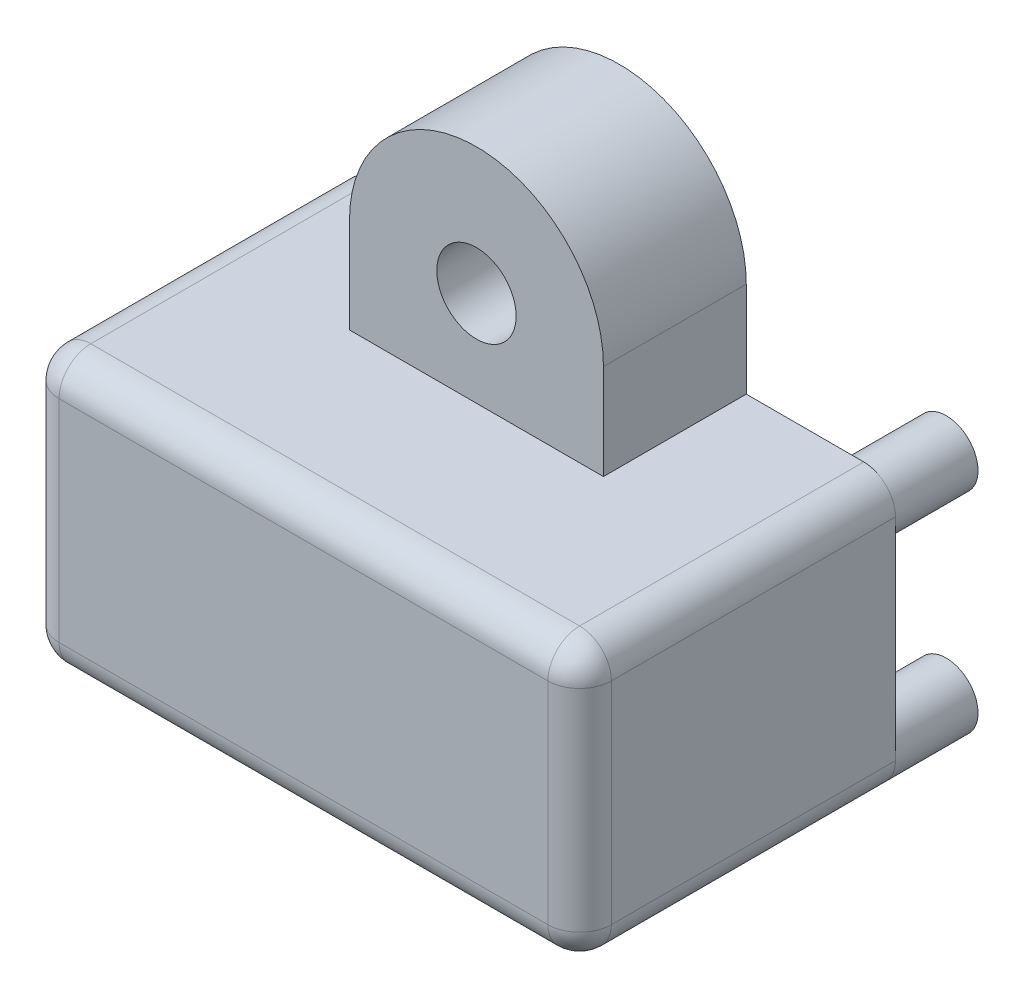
from build123d import *

# Parameters (mm, degrees)
ESQUISSE1_W             = 17.4
ESQUISSE1_H             = 8.65
BOSS_EXTRU_1_DEPTH      = 9.95
ESQUISSE2_R             = 1.25
BOSS_EXTRU_2_DEPTH      = 4.5
ESQUISSE3_R             = 2.6
ENL_V_MAT_EXTRU_1_DEPTH = 2
ESQUISSE4_R             = 1
BOSS_EXTRU_3_DEPTH      = 2.6
CONG_1_R                = 1


with BuildPart() as part:
    # Esquisse1 → Boss.-Extru.1 (new body)
    with BuildSketch(Plane.XY):
        with Locations((-33.638931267, 31.897425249)):
            Rectangle(ESQUISSE1_W, ESQUISSE1_H)
    extrude(amount=BOSS_EXTRU_1_DEPTH)

    # Esquisse2 → Boss.-Extru.2 (add)
    with BuildSketch(Plane(origin=(0, 0, 0), x_dir=(-1, 0, 0), z_dir=(0, 0, -1))):
        with BuildLine():
            Line((29.638931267, 39.222425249), (29.638931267, 36.222425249))
            Line((29.638931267, 36.222425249), (37.638931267, 36.222425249))
            Line((37.638931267, 36.222425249), (37.638931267, 39.222425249))
            ThreePointArc((37.638931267, 39.222425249), (33.638931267, 43.222425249), (29.638931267, 39.222425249))
        make_face()
        with Locations((33.638931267, 39.222425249)):
            Circle(ESQUISSE2_R, mode=Mode.SUBTRACT)
    extrude(amount=-BOSS_EXTRU_2_DEPTH)

    # Esquisse3 → Enl_v. mat.-Extru.1 (cut)
    with BuildSketch(Plane(origin=(0, 0, 0), x_dir=(-1, 0, 0), z_dir=(0, 0, -1))):
        with Locations((33.638931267, 39.222425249)):
            Circle(ESQUISSE3_R)
    extrude(amount=-ENL_V_MAT_EXTRU_1_DEPTH, mode=Mode.SUBTRACT)

    # Esquisse4 → Boss.-Extru.3 (add)
    with BuildSketch(Plane(origin=(0, 0, 0), x_dir=(-1, 0, 0), z_dir=(0, 0, -1))):
        with Locations(Location((25.938931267, 35.18493644, 0), (0, 0, 180))):
            Circle(ESQUISSE4_R)
        with Locations(Location((25.938931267, 28.572425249, 0), (0, 0, 180))):
            Circle(ESQUISSE4_R)
        with Locations(Location((41.338931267, 28.572425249, 0), (0, 0, 180))):
            Circle(ESQUISSE4_R)
        with Locations(Location((41.338931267, 35.18493644, 0), (0, 0, 180))):
            Circle(ESQUISSE4_R)
    extrude(amount=BOSS_EXTRU_3_DEPTH)

    # Cong_1
    cong_1_edges = [part.edges().sort_by_distance(p)[0] for p in [
        (-33.638931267, 36.222425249, 9.95),
        (-24.938931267, 31.897425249, 9.95),
        (-33.638931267, 27.572425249, 9.95),
        (-42.338931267, 31.897425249, 9.95),
        (-24.938931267, 27.572425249, 4.975),
        (-24.938931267, 36.222425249, 4.975),
        (-42.338931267, 27.572425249, 4.975),
        (-42.338931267, 36.222425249, 4.975),
    ]]
    fillet(cong_1_edges, radius=CONG_1_R)


solid = part.part
